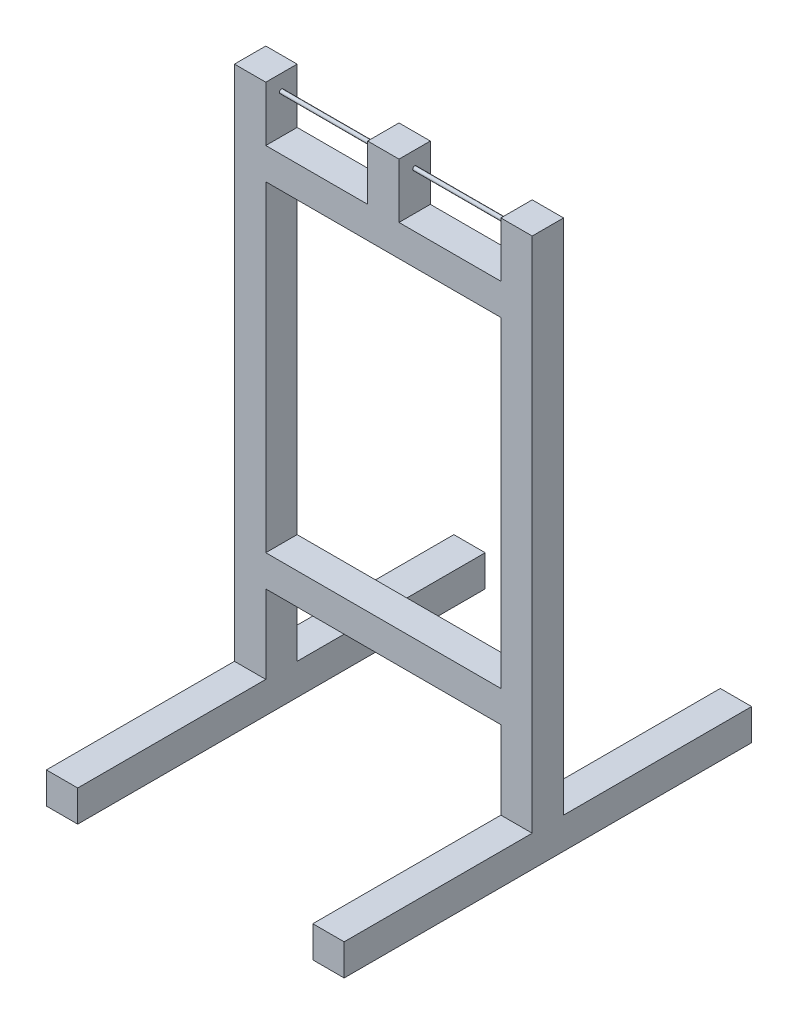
from build123d import *

# Parameters (mm, degrees)
ESQUISSE1_W                = 25.4
ESQUISSE1_H                = 25.4
BOSS_EXTRU_1_DEPTH         = 165.1
ESQUISSE2_W                = 25.4
ESQUISSE2_H                = 25.4
BOSS_EXTRU_2_DEPTH         = 431.8
R_P_TITION_LIN_AIRE1_COUNT = 2
R_P_TITION_LIN_AIRE1_PITCH = 215.9
BOSS_EXTRU_3_START         = 12.7
ESQUISSE3_W                = 25.4
ESQUISSE3_H                = 25.4
BOSS_EXTRU_3_DEPTH         = 190.5
R_P_TITION_LIN_AIRE2_COUNT = 2
R_P_TITION_LIN_AIRE2_PITCH = 285.75
BOSS_EXTRU_4_REACH         = 512.218
ESQUISSE4_R                = 1.5875
ESQUISSE6_W                = 25.4
ESQUISSE6_H                = 25.4
BOSS_EXTRU_5_DEPTH         = 44.45


with BuildPart() as part:
    # Esquisse1 → Boss.-Extru.1 (new, symmetric)
    with BuildSketch(Plane.XY):
        Rectangle(ESQUISSE1_W, ESQUISSE1_H)
    extrude(amount=BOSS_EXTRU_1_DEPTH, both=True)

    # Esquisse2 → Boss.-Extru.2 (add)
    with BuildSketch(Plane(origin=(0, 0, 0), x_dir=(1, 0, 0), z_dir=(0, 1, 0))):
        Rectangle(ESQUISSE2_W, ESQUISSE2_H)
    extrude(amount=BOSS_EXTRU_2_DEPTH)


with BuildPart() as r_p_tition_lin_aire1_1:
    # R_p_tition lin_aire1: pattern copy
    add(part.part.moved(Location(Vector(1, 0, 0) * (1 * R_P_TITION_LIN_AIRE1_PITCH))))


with BuildPart() as part_1:
    add(part.part)

    # Esquisse3 → Boss.-Extru.3 (add)
    with BuildSketch(Plane(origin=(0, 0, 0), x_dir=(0, 0, -1), z_dir=(1, 0, 0)).offset(BOSS_EXTRU_3_START)):
        with Locations((0, 88.9)):
            Rectangle(ESQUISSE3_W, ESQUISSE3_H)
    boss_extru_3 = extrude(amount=BOSS_EXTRU_3_DEPTH)

    add(r_p_tition_lin_aire1_1.part)  # R_p_tition lin_aire2 merges R_p_tition lin_aire1_1
    # R_p_tition lin_aire2: Boss.-Extru.3 ×2
    with Locations(*[(0, i * R_P_TITION_LIN_AIRE2_PITCH, 0) for i in range(1, R_P_TITION_LIN_AIRE2_COUNT)]):
        add(boss_extru_3)

    # Esquisse4 → Boss.-Extru.4 (add, up to next)
    with BuildSketch(Plane(origin=(12.7, 0, 0), x_dir=(0, 0, -1), z_dir=(1, 0, 0)), mode=Mode.PRIVATE) as boss_extru_4_sk1:
        with Locations(Location((0, 419.1, 0), (0, 0, 180))):
            Circle(ESQUISSE4_R)
    boss_extru_4_tool1 = extrude(boss_extru_4_sk1.sketch, amount=BOSS_EXTRU_4_REACH, mode=Mode.PRIVATE) - part_1.part
    add(boss_extru_4_tool1.solids().sort_by_distance((12.7, 419.1, 0))[0])

    # Esquisse6 → Boss.-Extru.5 (add)
    with BuildSketch(Plane(origin=(0, 387.35, 0), x_dir=(1, 0, 0), z_dir=(0, 1, 0))):
        with Locations((107.95, 0)):
            Rectangle(ESQUISSE6_W, ESQUISSE6_H)
    extrude(amount=BOSS_EXTRU_5_DEPTH)


solid = part_1.part
